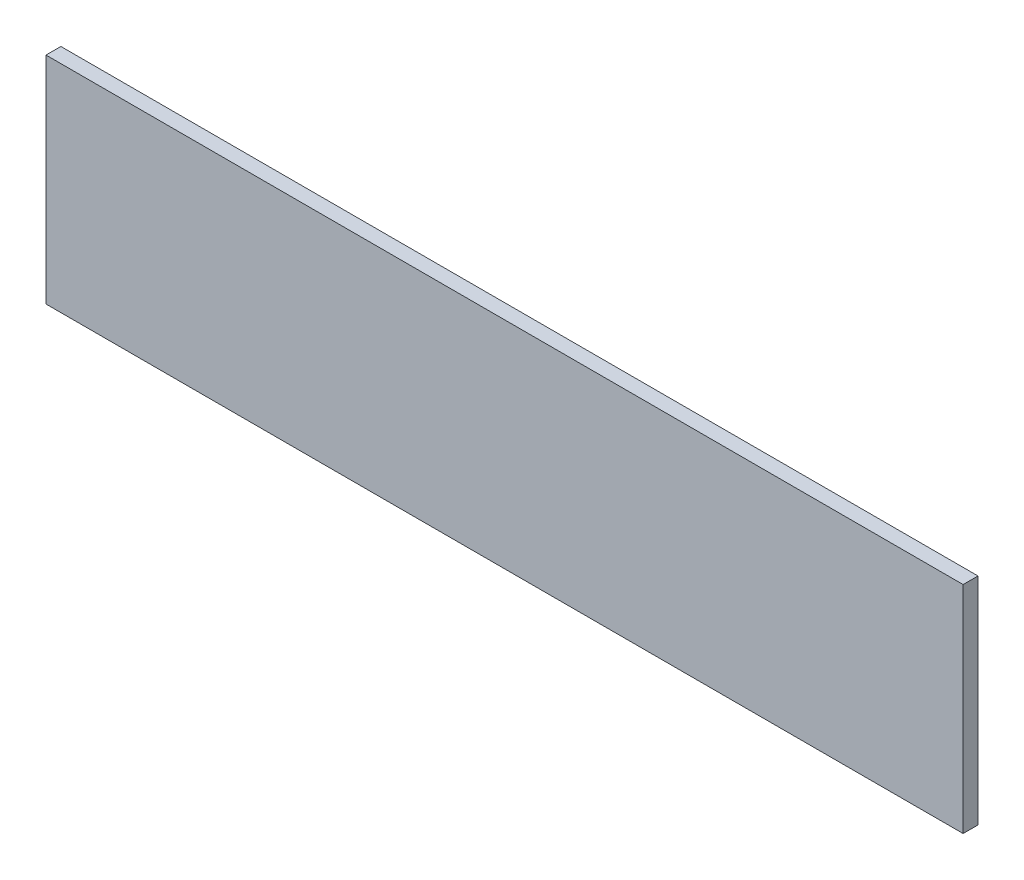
ISO-10303-21;
HEADER;
FILE_DESCRIPTION(('STEP AP214'),'2;1');
FILE_NAME('part.step','',(''),(''),'','','');
FILE_SCHEMA(('AUTOMOTIVE_DESIGN { 1 0 10303 214 1 1 1 1 }'));
ENDSEC;
DATA;
#1=APPLICATION_CONTEXT('core data for automotive mechanical design processes');
#2=APPLICATION_PROTOCOL_DEFINITION('international standard','automotive_design',2000,#1);
#3=PRODUCT_CONTEXT('',#1,'mechanical');
#4=PRODUCT('Part','Part','',(#3));
#5=PRODUCT_RELATED_PRODUCT_CATEGORY('part','',(#4));
#6=PRODUCT_DEFINITION_FORMATION('','',#4);
#7=PRODUCT_DEFINITION_CONTEXT('part definition',#1,'design');
#8=PRODUCT_DEFINITION('design','',#6,#7);
#9=PRODUCT_DEFINITION_SHAPE('','',#8);
#10=(LENGTH_UNIT() NAMED_UNIT(*) SI_UNIT(.MILLI.,.METRE.));
#11=(NAMED_UNIT(*) PLANE_ANGLE_UNIT() SI_UNIT($,.RADIAN.));
#12=(NAMED_UNIT(*) SI_UNIT($,.STERADIAN.) SOLID_ANGLE_UNIT());
#13=UNCERTAINTY_MEASURE_WITH_UNIT(LENGTH_MEASURE(1.E-05),#10,'distance_accuracy_value','');
#14=(GEOMETRIC_REPRESENTATION_CONTEXT(3) GLOBAL_UNCERTAINTY_ASSIGNED_CONTEXT((#13)) GLOBAL_UNIT_ASSIGNED_CONTEXT((#10,
#11,#12)) REPRESENTATION_CONTEXT('',''));
#15=CARTESIAN_POINT('',(0.,0.,0.));
#16=DIRECTION('',(0.,0.,1.));
#17=DIRECTION('',(1.,0.,0.));
#18=AXIS2_PLACEMENT_3D('',#15,#16,#17);
#19=CARTESIAN_POINT('',(0.,0.,6.));
#20=DIRECTION('',(1.,0.,0.));
#21=DIRECTION('',(0.,0.,-1.));
#22=AXIS2_PLACEMENT_3D('',#19,#20,#21);
#23=PLANE('',#22);
#24=DIRECTION('',(0.,-1.,0.));
#25=VECTOR('',#24,1.);
#26=CARTESIAN_POINT('',(0.,0.,0.));
#27=LINE('',#26,#25);
#28=CARTESIAN_POINT('',(0.,87.,0.));
#29=VERTEX_POINT('',#28);
#30=CARTESIAN_POINT('',(0.,0.,0.));
#31=VERTEX_POINT('',#30);
#32=EDGE_CURVE('E83',#29,#31,#27,.T.);
#33=ORIENTED_EDGE('',*,*,#32,.T.);
#34=DIRECTION('',(0.,0.,-1.));
#35=VECTOR('',#34,1.);
#36=CARTESIAN_POINT('',(0.,0.,6.));
#37=LINE('',#36,#35);
#38=CARTESIAN_POINT('',(0.,0.,6.));
#39=VERTEX_POINT('',#38);
#40=EDGE_CURVE('E11',#39,#31,#37,.T.);
#41=ORIENTED_EDGE('',*,*,#40,.F.);
#42=DIRECTION('',(0.,-1.,0.));
#43=VECTOR('',#42,1.);
#44=CARTESIAN_POINT('',(0.,0.,6.));
#45=LINE('',#44,#43);
#46=CARTESIAN_POINT('',(0.,87.,6.));
#47=VERTEX_POINT('',#46);
#48=EDGE_CURVE('E101',#47,#39,#45,.T.);
#49=ORIENTED_EDGE('',*,*,#48,.F.);
#50=DIRECTION('',(0.,0.,-1.));
#51=VECTOR('',#50,1.);
#52=CARTESIAN_POINT('',(0.,87.,6.));
#53=LINE('',#52,#51);
#54=EDGE_CURVE('E95',#47,#29,#53,.T.);
#55=ORIENTED_EDGE('',*,*,#54,.T.);
#56=EDGE_LOOP('',(#33,#41,#49,#55));
#57=FACE_BOUND('',#56,.T.);
#58=ADVANCED_FACE('F39',(#57),#23,.F.);
#59=CARTESIAN_POINT('',(0.,0.,6.));
#60=DIRECTION('',(0.,1.,0.));
#61=DIRECTION('',(0.,0.,1.));
#62=AXIS2_PLACEMENT_3D('',#59,#60,#61);
#63=PLANE('',#62);
#64=DIRECTION('',(1.,0.,0.));
#65=VECTOR('',#64,1.);
#66=CARTESIAN_POINT('',(0.,0.,0.));
#67=LINE('',#66,#65);
#68=CARTESIAN_POINT('',(370.,0.,0.));
#69=VERTEX_POINT('',#68);
#70=EDGE_CURVE('E79',#31,#69,#67,.T.);
#71=ORIENTED_EDGE('',*,*,#70,.T.);
#72=DIRECTION('',(0.,0.,-1.));
#73=VECTOR('',#72,1.);
#74=CARTESIAN_POINT('',(370.,0.,6.));
#75=LINE('',#74,#73);
#76=CARTESIAN_POINT('',(370.,0.,6.));
#77=VERTEX_POINT('',#76);
#78=EDGE_CURVE('E46',#77,#69,#75,.T.);
#79=ORIENTED_EDGE('',*,*,#78,.F.);
#80=DIRECTION('',(1.,0.,0.));
#81=VECTOR('',#80,1.);
#82=CARTESIAN_POINT('',(0.,0.,6.));
#83=LINE('',#82,#81);
#84=EDGE_CURVE('E91',#39,#77,#83,.T.);
#85=ORIENTED_EDGE('',*,*,#84,.F.);
#86=ORIENTED_EDGE('',*,*,#40,.T.);
#87=EDGE_LOOP('',(#71,#79,#85,#86));
#88=FACE_BOUND('',#87,.T.);
#89=ADVANCED_FACE('F90',(#88),#63,.F.);
#90=CARTESIAN_POINT('',(370.,0.,6.));
#91=DIRECTION('',(-1.,0.,0.));
#92=DIRECTION('',(0.,0.,1.));
#93=AXIS2_PLACEMENT_3D('',#90,#91,#92);
#94=PLANE('',#93);
#95=DIRECTION('',(0.,1.,0.));
#96=VECTOR('',#95,1.);
#97=CARTESIAN_POINT('',(370.,0.,0.));
#98=LINE('',#97,#96);
#99=CARTESIAN_POINT('',(370.,87.,0.));
#100=VERTEX_POINT('',#99);
#101=EDGE_CURVE('E84',#69,#100,#98,.T.);
#102=ORIENTED_EDGE('',*,*,#101,.T.);
#103=DIRECTION('',(0.,0.,-1.));
#104=VECTOR('',#103,1.);
#105=CARTESIAN_POINT('',(370.,87.,6.));
#106=LINE('',#105,#104);
#107=CARTESIAN_POINT('',(370.,87.,6.));
#108=VERTEX_POINT('',#107);
#109=EDGE_CURVE('E107',#108,#100,#106,.T.);
#110=ORIENTED_EDGE('',*,*,#109,.F.);
#111=DIRECTION('',(0.,1.,0.));
#112=VECTOR('',#111,1.);
#113=CARTESIAN_POINT('',(370.,0.,6.));
#114=LINE('',#113,#112);
#115=EDGE_CURVE('E58',#77,#108,#114,.T.);
#116=ORIENTED_EDGE('',*,*,#115,.F.);
#117=ORIENTED_EDGE('',*,*,#78,.T.);
#118=EDGE_LOOP('',(#102,#110,#116,#117));
#119=FACE_BOUND('',#118,.T.);
#120=ADVANCED_FACE('F110',(#119),#94,.F.);
#121=CARTESIAN_POINT('',(0.,87.,6.));
#122=DIRECTION('',(0.,-1.,0.));
#123=DIRECTION('',(0.,0.,-1.));
#124=AXIS2_PLACEMENT_3D('',#121,#122,#123);
#125=PLANE('',#124);
#126=DIRECTION('',(-1.,0.,0.));
#127=VECTOR('',#126,1.);
#128=CARTESIAN_POINT('',(0.,87.,0.));
#129=LINE('',#128,#127);
#130=EDGE_CURVE('E99',#100,#29,#129,.T.);
#131=ORIENTED_EDGE('',*,*,#130,.T.);
#132=ORIENTED_EDGE('',*,*,#54,.F.);
#133=DIRECTION('',(-1.,0.,0.));
#134=VECTOR('',#133,1.);
#135=CARTESIAN_POINT('',(0.,87.,6.));
#136=LINE('',#135,#134);
#137=EDGE_CURVE('E53',#108,#47,#136,.T.);
#138=ORIENTED_EDGE('',*,*,#137,.F.);
#139=ORIENTED_EDGE('',*,*,#109,.T.);
#140=EDGE_LOOP('',(#131,#132,#138,#139));
#141=FACE_BOUND('',#140,.T.);
#142=ADVANCED_FACE('F112',(#141),#125,.F.);
#143=CARTESIAN_POINT('',(0.,87.,6.));
#144=DIRECTION('',(0.,0.,-1.));
#145=DIRECTION('',(-1.,0.,0.));
#146=AXIS2_PLACEMENT_3D('',#143,#144,#145);
#147=PLANE('',#146);
#148=ORIENTED_EDGE('',*,*,#48,.T.);
#149=ORIENTED_EDGE('',*,*,#84,.T.);
#150=ORIENTED_EDGE('',*,*,#115,.T.);
#151=ORIENTED_EDGE('',*,*,#137,.T.);
#152=EDGE_LOOP('',(#148,#149,#150,#151));
#153=FACE_BOUND('',#152,.T.);
#154=ADVANCED_FACE('F113',(#153),#147,.F.);
#155=CARTESIAN_POINT('',(0.,87.,0.));
#156=DIRECTION('',(0.,0.,-1.));
#157=DIRECTION('',(-1.,0.,0.));
#158=AXIS2_PLACEMENT_3D('',#155,#156,#157);
#159=PLANE('',#158);
#160=ORIENTED_EDGE('',*,*,#32,.F.);
#161=ORIENTED_EDGE('',*,*,#130,.F.);
#162=ORIENTED_EDGE('',*,*,#101,.F.);
#163=ORIENTED_EDGE('',*,*,#70,.F.);
#164=EDGE_LOOP('',(#160,#161,#162,#163));
#165=FACE_BOUND('',#164,.T.);
#166=ADVANCED_FACE('F80',(#165),#159,.T.);
#167=CLOSED_SHELL('',(#58,#89,#120,#142,#154,#166));
#168=MANIFOLD_SOLID_BREP('B2',#167);
#169=ADVANCED_BREP_SHAPE_REPRESENTATION('',(#18,#168),#14);
#170=SHAPE_DEFINITION_REPRESENTATION(#9,#169);
ENDSEC;
END-ISO-10303-21;
